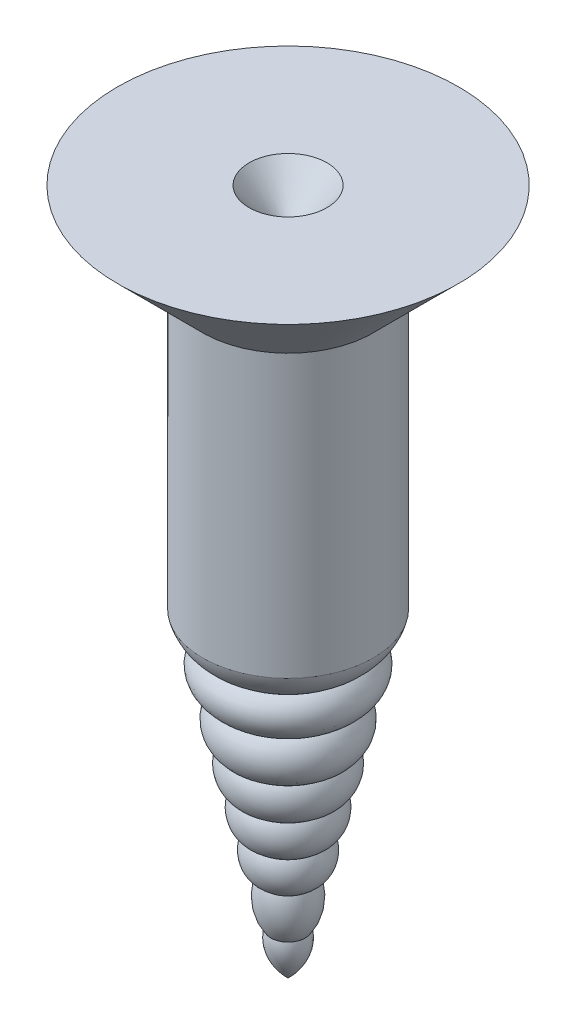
ISO-10303-21;
HEADER;
FILE_DESCRIPTION(('STEP AP214'),'2;1');
FILE_NAME('part.step','',(''),(''),'','','');
FILE_SCHEMA(('AUTOMOTIVE_DESIGN { 1 0 10303 214 1 1 1 1 }'));
ENDSEC;
DATA;
#1=APPLICATION_CONTEXT('core data for automotive mechanical design processes');
#2=APPLICATION_PROTOCOL_DEFINITION('international standard','automotive_design',2000,#1);
#3=PRODUCT_CONTEXT('',#1,'mechanical');
#4=PRODUCT('Part','Part','',(#3));
#5=PRODUCT_RELATED_PRODUCT_CATEGORY('part','',(#4));
#6=PRODUCT_DEFINITION_FORMATION('','',#4);
#7=PRODUCT_DEFINITION_CONTEXT('part definition',#1,'design');
#8=PRODUCT_DEFINITION('design','',#6,#7);
#9=PRODUCT_DEFINITION_SHAPE('','',#8);
#10=(LENGTH_UNIT() NAMED_UNIT(*) SI_UNIT(.MILLI.,.METRE.));
#11=(NAMED_UNIT(*) PLANE_ANGLE_UNIT() SI_UNIT($,.RADIAN.));
#12=(NAMED_UNIT(*) SI_UNIT($,.STERADIAN.) SOLID_ANGLE_UNIT());
#13=UNCERTAINTY_MEASURE_WITH_UNIT(LENGTH_MEASURE(1.E-05),#10,'distance_accuracy_value','');
#14=(GEOMETRIC_REPRESENTATION_CONTEXT(3) GLOBAL_UNCERTAINTY_ASSIGNED_CONTEXT((#13)) GLOBAL_UNIT_ASSIGNED_CONTEXT((#10,
#11,#12)) REPRESENTATION_CONTEXT('',''));
#15=CARTESIAN_POINT('',(0.,0.,0.));
#16=DIRECTION('',(0.,0.,1.));
#17=DIRECTION('',(1.,0.,0.));
#18=AXIS2_PLACEMENT_3D('',#15,#16,#17);
#19=CARTESIAN_POINT('',(3.17499999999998,0.875180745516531,0.));
#20=DIRECTION('',(0.,-1.,0.));
#21=DIRECTION('',(1.,0.,0.));
#22=AXIS2_PLACEMENT_3D('',#19,#20,#21);
#23=PLANE('',#22);
#24=CARTESIAN_POINT('',(0.,0.875180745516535,0.));
#25=DIRECTION('',(0.,1.,0.));
#26=DIRECTION('',(-1.,0.,0.));
#27=AXIS2_PLACEMENT_3D('',#24,#25,#26);
#28=CIRCLE('',#27,0.724771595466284);
#29=CARTESIAN_POINT('',(-0.724771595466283,0.875180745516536,0.));
#30=VERTEX_POINT('',#29);
#31=EDGE_CURVE('E11',#30,#30,#28,.T.);
#32=ORIENTED_EDGE('',*,*,#31,.F.);
#33=EDGE_LOOP('',(#32));
#34=FACE_BOUND('',#33,.T.);
#35=CARTESIAN_POINT('',(0.,0.875180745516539,0.));
#36=DIRECTION('',(0.,1.,0.));
#37=DIRECTION('',(-1.,0.,0.));
#38=AXIS2_PLACEMENT_3D('',#35,#36,#37);
#39=CIRCLE('',#38,3.17499999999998);
#40=CARTESIAN_POINT('',(-3.17499999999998,0.875180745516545,0.));
#41=VERTEX_POINT('',#40);
#42=EDGE_CURVE('E56',#41,#41,#39,.T.);
#43=ORIENTED_EDGE('',*,*,#42,.T.);
#44=EDGE_LOOP('',(#43));
#45=FACE_BOUND('',#44,.T.);
#46=ADVANCED_FACE('F33',(#34,#45),#23,.F.);
#47=CARTESIAN_POINT('',(0.,0.875180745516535,0.));
#48=DIRECTION('',(0.,1.,0.));
#49=DIRECTION('',(-1.,0.,0.));
#50=AXIS2_PLACEMENT_3D('',#47,#48,#49);
#51=CONICAL_SURFACE('',#50,0.724771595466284,0.691665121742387);
#52=CARTESIAN_POINT('',(0.,0.,0.));
#53=VERTEX_POINT('',#52);
#54=VERTEX_LOOP('',#53);
#55=FACE_BOUND('',#54,.T.);
#56=ORIENTED_EDGE('',*,*,#31,.T.);
#57=EDGE_LOOP('',(#56));
#58=FACE_BOUND('',#57,.T.);
#59=ADVANCED_FACE('F46',(#55,#58),#51,.F.);
#60=CARTESIAN_POINT('',(-1.87893447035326,-11.4260263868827,0.));
#61=DIRECTION('',(0.,0.,1.));
#62=DIRECTION('',(0.994021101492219,0.109188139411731,0.));
#63=AXIS2_PLACEMENT_3D('',#60,#61,#62);
#64=ELLIPSE('',#63,2.22369935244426,1.18534006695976);
#65=TRIMMED_CURVE('',#64,(PARAMETER_VALUE(5.66721326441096)),
(PARAMETER_VALUE(6.78218554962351)),.T.,.PARAMETER.);
#66=CARTESIAN_POINT('',(0.,0.,0.));
#67=DIRECTION('',(0.,1.,0.));
#68=AXIS1_PLACEMENT('',#66,#67);
#69=SURFACE_OF_REVOLUTION('',#65,#68);
#70=CARTESIAN_POINT('',(0.,-11.1063086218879,0.));
#71=DIRECTION('',(0.,1.,0.));
#72=DIRECTION('',(-1.,0.,0.));
#73=AXIS2_PLACEMENT_3D('',#70,#71,#72);
#74=CIRCLE('',#73,0.318183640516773);
#75=CARTESIAN_POINT('',(-0.318183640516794,-11.1063086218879,0.));
#76=VERTEX_POINT('',#75);
#77=EDGE_CURVE('E40',#76,#76,#74,.T.);
#78=ORIENTED_EDGE('',*,*,#77,.F.);
#79=EDGE_LOOP('',(#78));
#80=FACE_BOUND('',#79,.T.);
#81=CARTESIAN_POINT('',(0.,-11.908587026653,0.));
#82=VERTEX_POINT('',#81);
#83=VERTEX_LOOP('',#82);
#84=FACE_BOUND('',#83,.T.);
#85=ADVANCED_FACE('F49',(#80,#84),#69,.T.);
#86=CARTESIAN_POINT('',(-0.215651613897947,-10.5780038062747,0.));
#87=DIRECTION('',(0.,0.,1.));
#88=DIRECTION('',(-4.30671117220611E-05,-0.999999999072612,0.));
#89=AXIS2_PLACEMENT_3D('',#86,#87,#88);
#90=ELLIPSE('',#89,0.816183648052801,0.70035239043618);
#91=TRIMMED_CURVE('',#90,(PARAMETER_VALUE(0.31305488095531)),
(PARAMETER_VALUE(2.82863815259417)),.T.,.PARAMETER.);
#92=CARTESIAN_POINT('',(0.,0.,0.));
#93=DIRECTION('',(0.,1.,0.));
#94=AXIS1_PLACEMENT('',#92,#93);
#95=SURFACE_OF_REVOLUTION('',#91,#94);
#96=CARTESIAN_POINT('',(0.,-10.2791147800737,0.));
#97=DIRECTION('',(0.,1.,0.));
#98=DIRECTION('',(-1.,0.,0.));
#99=AXIS2_PLACEMENT_3D('',#96,#97,#98);
#100=CIRCLE('',#99,0.436054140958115);
#101=CARTESIAN_POINT('',(-0.436054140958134,-10.2791147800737,0.));
#102=VERTEX_POINT('',#101);
#103=EDGE_CURVE('E84',#102,#102,#100,.T.);
#104=ORIENTED_EDGE('',*,*,#103,.F.);
#105=EDGE_LOOP('',(#104));
#106=FACE_BOUND('',#105,.T.);
#107=ORIENTED_EDGE('',*,*,#77,.T.);
#108=EDGE_LOOP('',(#107));
#109=FACE_BOUND('',#108,.T.);
#110=ADVANCED_FACE('F89',(#106,#109),#95,.T.);
#111=CARTESIAN_POINT('',(0.175609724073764,-9.84354900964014,0.));
#112=DIRECTION('',(0.,0.,1.));
#113=DIRECTION('',(0.000200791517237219,0.999999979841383,0.));
#114=AXIS2_PLACEMENT_3D('',#111,#112,#113);
#115=ELLIPSE('',#114,0.513717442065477,0.491229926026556);
#116=TRIMMED_CURVE('',#115,(PARAMETER_VALUE(2.77622387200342)),
(PARAMETER_VALUE(6.64897405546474)),.T.,.PARAMETER.);
#117=CARTESIAN_POINT('',(0.,0.,0.));
#118=DIRECTION('',(0.,1.,0.));
#119=AXIS1_PLACEMENT('',#117,#118);
#120=SURFACE_OF_REVOLUTION('',#116,#119);
#121=CARTESIAN_POINT('',(0.,-9.58029618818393,0.));
#122=DIRECTION('',(0.,1.,0.));
#123=DIRECTION('',(-1.,0.,0.));
#124=AXIS2_PLACEMENT_3D('',#121,#122,#123);
#125=CIRCLE('',#124,0.597442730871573);
#126=CARTESIAN_POINT('',(-0.597442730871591,-9.58029618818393,0.));
#127=VERTEX_POINT('',#126);
#128=EDGE_CURVE('E81',#127,#127,#125,.T.);
#129=ORIENTED_EDGE('',*,*,#128,.F.);
#130=EDGE_LOOP('',(#129));
#131=FACE_BOUND('',#130,.T.);
#132=ORIENTED_EDGE('',*,*,#103,.T.);
#133=EDGE_LOOP('',(#132));
#134=FACE_BOUND('',#133,.T.);
#135=ADVANCED_FACE('F96',(#131,#134),#120,.T.);
#136=CARTESIAN_POINT('',(0.382109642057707,-9.15092333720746,0.));
#137=DIRECTION('',(0.,0.,1.));
#138=DIRECTION('',(-0.000931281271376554,-0.999999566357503,0.));
#139=AXIS2_PLACEMENT_3D('',#136,#137,#138);
#140=ELLIPSE('',#139,0.490310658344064,0.446126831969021);
#141=TRIMMED_CURVE('',#140,(PARAMETER_VALUE(-1.0274350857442)),
(PARAMETER_VALUE(4.17107476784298)),.T.,.PARAMETER.);
#142=CARTESIAN_POINT('',(0.,0.,0.));
#143=DIRECTION('',(0.,1.,0.));
#144=AXIS1_PLACEMENT('',#142,#143);
#145=SURFACE_OF_REVOLUTION('',#141,#144);
#146=CARTESIAN_POINT('',(0.,-8.87807450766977,0.));
#147=DIRECTION('',(0.,1.,0.));
#148=DIRECTION('',(-1.,0.,0.));
#149=AXIS2_PLACEMENT_3D('',#146,#147,#148);
#150=CIRCLE('',#149,0.75282231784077);
#151=CARTESIAN_POINT('',(-0.752822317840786,-8.87807450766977,0.));
#152=VERTEX_POINT('',#151);
#153=EDGE_CURVE('E78',#152,#152,#150,.T.);
#154=ORIENTED_EDGE('',*,*,#153,.F.);
#155=EDGE_LOOP('',(#154));
#156=FACE_BOUND('',#155,.T.);
#157=ORIENTED_EDGE('',*,*,#128,.T.);
#158=EDGE_LOOP('',(#157));
#159=FACE_BOUND('',#158,.T.);
#160=ADVANCED_FACE('F111',(#156,#159),#145,.T.);
#161=CARTESIAN_POINT('',(0.540349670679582,-8.45373080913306,0.));
#162=DIRECTION('',(0.,0.,1.));
#163=DIRECTION('',(0.139722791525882,0.99019065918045,0.));
#164=AXIS2_PLACEMENT_3D('',#161,#162,#163);
#165=ELLIPSE('',#164,0.486394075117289,0.452328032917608);
#166=CARTESIAN_POINT('',(0.,0.,0.));
#167=DIRECTION('',(0.,1.,0.));
#168=AXIS1_PLACEMENT('',#166,#167);
#169=SURFACE_OF_REVOLUTION('',#165,#168);
#170=CARTESIAN_POINT('',(0.,-8.16676538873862,0.));
#171=DIRECTION('',(0.,1.,0.));
#172=DIRECTION('',(-1.,0.,0.));
#173=AXIS2_PLACEMENT_3D('',#170,#171,#172);
#174=CIRCLE('',#173,0.911170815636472);
#175=CARTESIAN_POINT('',(-0.911170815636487,-8.16676538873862,0.));
#176=VERTEX_POINT('',#175);
#177=EDGE_CURVE('E75',#176,#176,#174,.T.);
#178=ORIENTED_EDGE('',*,*,#177,.F.);
#179=EDGE_LOOP('',(#178));
#180=FACE_BOUND('',#179,.T.);
#181=ORIENTED_EDGE('',*,*,#153,.T.);
#182=EDGE_LOOP('',(#181));
#183=FACE_BOUND('',#182,.T.);
#184=ADVANCED_FACE('F115',(#180,#183),#169,.T.);
#185=CARTESIAN_POINT('',(0.649000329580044,-7.72480915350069,0.));
#186=DIRECTION('',(0.,0.,1.));
#187=DIRECTION('',(0.0117514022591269,0.999930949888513,0.));
#188=AXIS2_PLACEMENT_3D('',#185,#186,#187);
#189=ELLIPSE('',#188,0.514524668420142,0.512105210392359);
#190=CARTESIAN_POINT('',(0.,0.,0.));
#191=DIRECTION('',(0.,1.,0.));
#192=AXIS1_PLACEMENT('',#190,#191);
#193=SURFACE_OF_REVOLUTION('',#189,#192);
#194=CARTESIAN_POINT('',(0.,-7.33728155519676,0.));
#195=DIRECTION('',(0.,1.,0.));
#196=DIRECTION('',(-1.,0.,0.));
#197=AXIS2_PLACEMENT_3D('',#194,#195,#196);
#198=CIRCLE('',#197,0.985915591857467);
#199=CARTESIAN_POINT('',(-0.985915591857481,-7.33728155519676,0.));
#200=VERTEX_POINT('',#199);
#201=EDGE_CURVE('E72',#200,#200,#198,.T.);
#202=ORIENTED_EDGE('',*,*,#201,.F.);
#203=EDGE_LOOP('',(#202));
#204=FACE_BOUND('',#203,.T.);
#205=ORIENTED_EDGE('',*,*,#177,.T.);
#206=EDGE_LOOP('',(#205));
#207=FACE_BOUND('',#206,.T.);
#208=ADVANCED_FACE('F119',(#204,#207),#193,.T.);
#209=CARTESIAN_POINT('',(0.562288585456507,-6.8726576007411,0.));
#210=DIRECTION('',(0.,0.,1.));
#211=DIRECTION('',(0.997364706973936,0.0725509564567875,0.));
#212=AXIS2_PLACEMENT_3D('',#209,#210,#211);
#213=ELLIPSE('',#212,0.808616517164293,0.563554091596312);
#214=TRIMMED_CURVE('',#213,(PARAMETER_VALUE(3.89148600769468)),
(PARAMETER_VALUE(8.57357736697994)),.T.,.PARAMETER.);
#215=CARTESIAN_POINT('',(0.,0.,0.));
#216=DIRECTION('',(0.,1.,0.));
#217=AXIS1_PLACEMENT('',#215,#216);
#218=SURFACE_OF_REVOLUTION('',#214,#217);
#219=CARTESIAN_POINT('',(0.,-6.49617810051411,0.));
#220=DIRECTION('',(0.,1.,0.));
#221=DIRECTION('',(-1.,0.,0.));
#222=AXIS2_PLACEMENT_3D('',#219,#220,#221);
#223=CIRCLE('',#222,1.19234987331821);
#224=CARTESIAN_POINT('',(-1.19234987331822,-6.4961781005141,0.));
#225=VERTEX_POINT('',#224);
#226=EDGE_CURVE('E69',#225,#225,#223,.T.);
#227=ORIENTED_EDGE('',*,*,#226,.F.);
#228=EDGE_LOOP('',(#227));
#229=FACE_BOUND('',#228,.T.);
#230=ORIENTED_EDGE('',*,*,#201,.T.);
#231=EDGE_LOOP('',(#230));
#232=FACE_BOUND('',#231,.T.);
#233=ADVANCED_FACE('F126',(#229,#232),#218,.T.);
#234=CARTESIAN_POINT('',(0.387600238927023,-5.78345727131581,0.));
#235=DIRECTION('',(0.,0.,1.));
#236=DIRECTION('',(0.999985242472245,-0.00543275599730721,0.));
#237=AXIS2_PLACEMENT_3D('',#234,#235,#236);
#238=ELLIPSE('',#237,1.21935392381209,0.946356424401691);
#239=TRIMMED_CURVE('',#238,(PARAMETER_VALUE(4.39311772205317)),
(PARAMETER_VALUE(8.1816858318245)),.T.,.PARAMETER.);
#240=CARTESIAN_POINT('',(0.,0.,0.));
#241=DIRECTION('',(0.,1.,0.));
#242=AXIS1_PLACEMENT('',#240,#241);
#243=SURFACE_OF_REVOLUTION('',#239,#242);
#244=CARTESIAN_POINT('',(0.,-5.95439299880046,0.));
#245=DIRECTION('',(0.,1.,0.));
#246=DIRECTION('',(-1.,0.,0.));
#247=AXIS2_PLACEMENT_3D('',#244,#245,#246);
#248=CIRCLE('',#247,1.5875);
#249=CARTESIAN_POINT('',(-1.58750000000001,-5.95439299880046,0.));
#250=VERTEX_POINT('',#249);
#251=EDGE_CURVE('E61',#250,#250,#248,.T.);
#252=ORIENTED_EDGE('',*,*,#251,.F.);
#253=EDGE_LOOP('',(#252));
#254=FACE_BOUND('',#253,.T.);
#255=ORIENTED_EDGE('',*,*,#226,.T.);
#256=EDGE_LOOP('',(#255));
#257=FACE_BOUND('',#256,.T.);
#258=ADVANCED_FACE('F129',(#254,#257),#243,.T.);
#259=CARTESIAN_POINT('',(0.,0.,0.));
#260=DIRECTION('',(0.,1.,0.));
#261=DIRECTION('',(-1.,0.,0.));
#262=AXIS2_PLACEMENT_3D('',#259,#260,#261);
#263=CYLINDRICAL_SURFACE('',#262,1.5875);
#264=CARTESIAN_POINT('',(0.,-0.712319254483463,0.));
#265=DIRECTION('',(0.,1.,0.));
#266=DIRECTION('',(-1.,0.,0.));
#267=AXIS2_PLACEMENT_3D('',#264,#265,#266);
#268=CIRCLE('',#267,1.58749999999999);
#269=CARTESIAN_POINT('',(-1.58749999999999,-0.71231925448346,0.));
#270=VERTEX_POINT('',#269);
#271=EDGE_CURVE('E58',#270,#270,#268,.T.);
#272=ORIENTED_EDGE('',*,*,#271,.F.);
#273=EDGE_LOOP('',(#272));
#274=FACE_BOUND('',#273,.T.);
#275=ORIENTED_EDGE('',*,*,#251,.T.);
#276=EDGE_LOOP('',(#275));
#277=FACE_BOUND('',#276,.T.);
#278=ADVANCED_FACE('F133',(#274,#277),#263,.T.);
#279=CARTESIAN_POINT('',(0.,-0.712319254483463,0.));
#280=DIRECTION('',(0.,1.,0.));
#281=DIRECTION('',(-1.,0.,0.));
#282=AXIS2_PLACEMENT_3D('',#279,#280,#281);
#283=CONICAL_SURFACE('',#282,1.58749999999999,0.785398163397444);
#284=ORIENTED_EDGE('',*,*,#42,.F.);
#285=EDGE_LOOP('',(#284));
#286=FACE_BOUND('',#285,.T.);
#287=ORIENTED_EDGE('',*,*,#271,.T.);
#288=EDGE_LOOP('',(#287));
#289=FACE_BOUND('',#288,.T.);
#290=ADVANCED_FACE('F137',(#286,#289),#283,.T.);
#291=CLOSED_SHELL('',(#46,#59,#85,#110,#135,#160,#184,#208,#233,#258,#278,#290));
#292=MANIFOLD_SOLID_BREP('B2',#291);
#293=ADVANCED_BREP_SHAPE_REPRESENTATION('',(#18,#292),#14);
#294=SHAPE_DEFINITION_REPRESENTATION(#9,#293);
ENDSEC;
END-ISO-10303-21;
